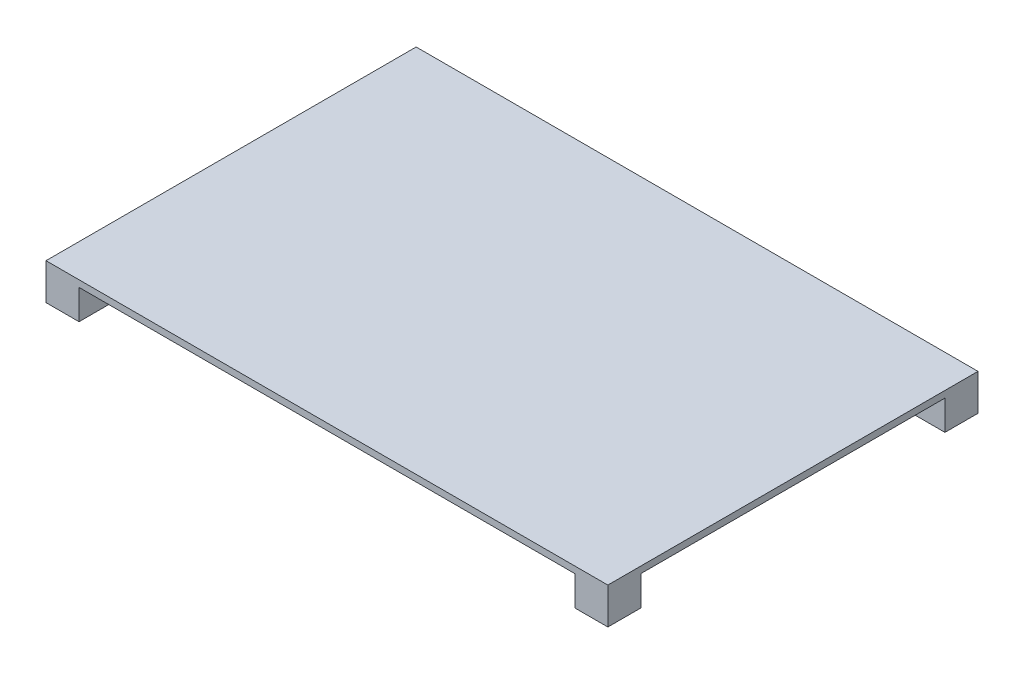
ISO-10303-21;
HEADER;
FILE_DESCRIPTION(('STEP AP214'),'2;1');
FILE_NAME('part.step','',(''),(''),'','','');
FILE_SCHEMA(('AUTOMOTIVE_DESIGN { 1 0 10303 214 1 1 1 1 }'));
ENDSEC;
DATA;
#1=APPLICATION_CONTEXT('core data for automotive mechanical design processes');
#2=APPLICATION_PROTOCOL_DEFINITION('international standard','automotive_design',2000,#1);
#3=PRODUCT_CONTEXT('',#1,'mechanical');
#4=PRODUCT('Part','Part','',(#3));
#5=PRODUCT_RELATED_PRODUCT_CATEGORY('part','',(#4));
#6=PRODUCT_DEFINITION_FORMATION('','',#4);
#7=PRODUCT_DEFINITION_CONTEXT('part definition',#1,'design');
#8=PRODUCT_DEFINITION('design','',#6,#7);
#9=PRODUCT_DEFINITION_SHAPE('','',#8);
#10=(LENGTH_UNIT() NAMED_UNIT(*) SI_UNIT(.MILLI.,.METRE.));
#11=(NAMED_UNIT(*) PLANE_ANGLE_UNIT() SI_UNIT($,.RADIAN.));
#12=(NAMED_UNIT(*) SI_UNIT($,.STERADIAN.) SOLID_ANGLE_UNIT());
#13=UNCERTAINTY_MEASURE_WITH_UNIT(LENGTH_MEASURE(1.E-05),#10,'distance_accuracy_value','');
#14=(GEOMETRIC_REPRESENTATION_CONTEXT(3) GLOBAL_UNCERTAINTY_ASSIGNED_CONTEXT((#13)) GLOBAL_UNIT_ASSIGNED_CONTEXT((#10,
#11,#12)) REPRESENTATION_CONTEXT('',''));
#15=CARTESIAN_POINT('',(0.,0.,0.));
#16=DIRECTION('',(0.,0.,1.));
#17=DIRECTION('',(1.,0.,0.));
#18=AXIS2_PLACEMENT_3D('',#15,#16,#17);
#19=CARTESIAN_POINT('',(0.,0.,0.));
#20=DIRECTION('',(0.,1.,0.));
#21=DIRECTION('',(0.,0.,1.));
#22=AXIS2_PLACEMENT_3D('',#19,#20,#21);
#23=PLANE('',#22);
#24=DIRECTION('',(0.,0.,-1.));
#25=VECTOR('',#24,1.);
#26=CARTESIAN_POINT('',(37.5,0.,28.));
#27=LINE('',#26,#25);
#28=CARTESIAN_POINT('',(37.5,0.,28.));
#29=VERTEX_POINT('',#28);
#30=CARTESIAN_POINT('',(37.5,0.,23.));
#31=VERTEX_POINT('',#30);
#32=EDGE_CURVE('E160',#29,#31,#27,.T.);
#33=ORIENTED_EDGE('',*,*,#32,.F.);
#34=DIRECTION('',(1.,0.,0.));
#35=VECTOR('',#34,1.);
#36=CARTESIAN_POINT('',(42.5,0.,28.));
#37=LINE('',#36,#35);
#38=CARTESIAN_POINT('',(-37.5,0.,28.));
#39=VERTEX_POINT('',#38);
#40=EDGE_CURVE('E311',#39,#29,#37,.T.);
#41=ORIENTED_EDGE('',*,*,#40,.F.);
#42=DIRECTION('',(0.,0.,1.));
#43=VECTOR('',#42,1.);
#44=CARTESIAN_POINT('',(-37.5,0.,28.));
#45=LINE('',#44,#43);
#46=CARTESIAN_POINT('',(-37.5,0.,23.));
#47=VERTEX_POINT('',#46);
#48=EDGE_CURVE('E265',#47,#39,#45,.T.);
#49=ORIENTED_EDGE('',*,*,#48,.F.);
#50=DIRECTION('',(1.,0.,0.));
#51=VECTOR('',#50,1.);
#52=CARTESIAN_POINT('',(-42.5,0.,23.));
#53=LINE('',#52,#51);
#54=CARTESIAN_POINT('',(-42.5,0.,23.));
#55=VERTEX_POINT('',#54);
#56=EDGE_CURVE('E248',#55,#47,#53,.T.);
#57=ORIENTED_EDGE('',*,*,#56,.F.);
#58=DIRECTION('',(0.,0.,1.));
#59=VECTOR('',#58,1.);
#60=CARTESIAN_POINT('',(-42.5,0.,28.));
#61=LINE('',#60,#59);
#62=CARTESIAN_POINT('',(-42.5,0.,-23.));
#63=VERTEX_POINT('',#62);
#64=EDGE_CURVE('E293',#63,#55,#61,.T.);
#65=ORIENTED_EDGE('',*,*,#64,.F.);
#66=DIRECTION('',(-1.,0.,0.));
#67=VECTOR('',#66,1.);
#68=CARTESIAN_POINT('',(-42.5,0.,-23.));
#69=LINE('',#68,#67);
#70=CARTESIAN_POINT('',(-37.5,0.,-23.));
#71=VERTEX_POINT('',#70);
#72=EDGE_CURVE('E241',#71,#63,#69,.T.);
#73=ORIENTED_EDGE('',*,*,#72,.F.);
#74=DIRECTION('',(0.,0.,1.));
#75=VECTOR('',#74,1.);
#76=CARTESIAN_POINT('',(-37.5,0.,-28.));
#77=LINE('',#76,#75);
#78=CARTESIAN_POINT('',(-37.5,0.,-28.));
#79=VERTEX_POINT('',#78);
#80=EDGE_CURVE('E244',#79,#71,#77,.T.);
#81=ORIENTED_EDGE('',*,*,#80,.F.);
#82=DIRECTION('',(-1.,0.,0.));
#83=VECTOR('',#82,1.);
#84=CARTESIAN_POINT('',(42.5,0.,-28.));
#85=LINE('',#84,#83);
#86=CARTESIAN_POINT('',(37.5,0.,-28.));
#87=VERTEX_POINT('',#86);
#88=EDGE_CURVE('E299',#87,#79,#85,.T.);
#89=ORIENTED_EDGE('',*,*,#88,.F.);
#90=DIRECTION('',(0.,0.,-1.));
#91=VECTOR('',#90,1.);
#92=CARTESIAN_POINT('',(37.5,0.,-28.));
#93=LINE('',#92,#91);
#94=CARTESIAN_POINT('',(37.5,0.,-23.));
#95=VERTEX_POINT('',#94);
#96=EDGE_CURVE('E209',#95,#87,#93,.T.);
#97=ORIENTED_EDGE('',*,*,#96,.F.);
#98=DIRECTION('',(-1.,0.,0.));
#99=VECTOR('',#98,1.);
#100=CARTESIAN_POINT('',(42.5,0.,-23.));
#101=LINE('',#100,#99);
#102=CARTESIAN_POINT('',(42.5,0.,-23.));
#103=VERTEX_POINT('',#102);
#104=EDGE_CURVE('E212',#103,#95,#101,.T.);
#105=ORIENTED_EDGE('',*,*,#104,.F.);
#106=DIRECTION('',(0.,0.,-1.));
#107=VECTOR('',#106,1.);
#108=CARTESIAN_POINT('',(42.5,0.,28.));
#109=LINE('',#108,#107);
#110=CARTESIAN_POINT('',(42.5,0.,23.));
#111=VERTEX_POINT('',#110);
#112=EDGE_CURVE('E182',#111,#103,#109,.T.);
#113=ORIENTED_EDGE('',*,*,#112,.F.);
#114=DIRECTION('',(1.,0.,0.));
#115=VECTOR('',#114,1.);
#116=CARTESIAN_POINT('',(42.5,0.,23.));
#117=LINE('',#116,#115);
#118=EDGE_CURVE('E173',#31,#111,#117,.T.);
#119=ORIENTED_EDGE('',*,*,#118,.F.);
#120=EDGE_LOOP('',(#33,#41,#49,#57,#65,#73,#81,#89,#97,#105,#113,#119));
#121=FACE_BOUND('',#120,.T.);
#122=ADVANCED_FACE('F45',(#121),#23,.F.);
#123=CARTESIAN_POINT('',(-42.5,1.,28.));
#124=DIRECTION('',(1.,0.,0.));
#125=DIRECTION('',(0.,0.,-1.));
#126=AXIS2_PLACEMENT_3D('',#123,#124,#125);
#127=PLANE('',#126);
#128=DIRECTION('',(0.,-1.,0.));
#129=VECTOR('',#128,1.);
#130=CARTESIAN_POINT('',(-42.5,1.,-28.));
#131=LINE('',#130,#129);
#132=CARTESIAN_POINT('',(-42.5,1.,-28.));
#133=VERTEX_POINT('',#132);
#134=CARTESIAN_POINT('',(-42.5,-4.5,-28.));
#135=VERTEX_POINT('',#134);
#136=EDGE_CURVE('E308',#133,#135,#131,.T.);
#137=ORIENTED_EDGE('',*,*,#136,.T.);
#138=DIRECTION('',(0.,0.,-1.));
#139=VECTOR('',#138,1.);
#140=CARTESIAN_POINT('',(-42.5,-4.5,-28.));
#141=LINE('',#140,#139);
#142=CARTESIAN_POINT('',(-42.5,-4.5,-23.));
#143=VERTEX_POINT('',#142);
#144=EDGE_CURVE('E245',#143,#135,#141,.T.);
#145=ORIENTED_EDGE('',*,*,#144,.F.);
#146=DIRECTION('',(0.,1.,0.));
#147=VECTOR('',#146,1.);
#148=CARTESIAN_POINT('',(-42.5,-4.5,-23.));
#149=LINE('',#148,#147);
#150=EDGE_CURVE('E236',#143,#63,#149,.T.);
#151=ORIENTED_EDGE('',*,*,#150,.T.);
#152=ORIENTED_EDGE('',*,*,#64,.T.);
#153=DIRECTION('',(0.,1.,0.));
#154=VECTOR('',#153,1.);
#155=CARTESIAN_POINT('',(-42.5,-4.5,23.));
#156=LINE('',#155,#154);
#157=CARTESIAN_POINT('',(-42.5,-4.5,23.));
#158=VERTEX_POINT('',#157);
#159=EDGE_CURVE('E289',#158,#55,#156,.T.);
#160=ORIENTED_EDGE('',*,*,#159,.F.);
#161=DIRECTION('',(0.,0.,-1.));
#162=VECTOR('',#161,1.);
#163=CARTESIAN_POINT('',(-42.5,-4.5,28.));
#164=LINE('',#163,#162);
#165=CARTESIAN_POINT('',(-42.5,-4.5,28.));
#166=VERTEX_POINT('',#165);
#167=EDGE_CURVE('E260',#166,#158,#164,.T.);
#168=ORIENTED_EDGE('',*,*,#167,.F.);
#169=DIRECTION('',(0.,-1.,0.));
#170=VECTOR('',#169,1.);
#171=CARTESIAN_POINT('',(-42.5,1.,28.));
#172=LINE('',#171,#170);
#173=CARTESIAN_POINT('',(-42.5,1.,28.));
#174=VERTEX_POINT('',#173);
#175=EDGE_CURVE('E11',#174,#166,#172,.T.);
#176=ORIENTED_EDGE('',*,*,#175,.F.);
#177=DIRECTION('',(0.,0.,1.));
#178=VECTOR('',#177,1.);
#179=CARTESIAN_POINT('',(-42.5,1.,28.));
#180=LINE('',#179,#178);
#181=EDGE_CURVE('E294',#133,#174,#180,.T.);
#182=ORIENTED_EDGE('',*,*,#181,.F.);
#183=EDGE_LOOP('',(#137,#145,#151,#152,#160,#168,#176,#182));
#184=FACE_BOUND('',#183,.T.);
#185=ADVANCED_FACE('F47',(#184),#127,.F.);
#186=CARTESIAN_POINT('',(42.5,1.,28.));
#187=DIRECTION('',(0.,0.,-1.));
#188=DIRECTION('',(-1.,0.,0.));
#189=AXIS2_PLACEMENT_3D('',#186,#187,#188);
#190=PLANE('',#189);
#191=ORIENTED_EDGE('',*,*,#175,.T.);
#192=DIRECTION('',(-1.,0.,0.));
#193=VECTOR('',#192,1.);
#194=CARTESIAN_POINT('',(-42.5,-4.5,28.));
#195=LINE('',#194,#193);
#196=CARTESIAN_POINT('',(-37.5,-4.5,28.));
#197=VERTEX_POINT('',#196);
#198=EDGE_CURVE('E271',#197,#166,#195,.T.);
#199=ORIENTED_EDGE('',*,*,#198,.F.);
#200=DIRECTION('',(0.,1.,0.));
#201=VECTOR('',#200,1.);
#202=CARTESIAN_POINT('',(-37.5,-4.5,28.));
#203=LINE('',#202,#201);
#204=EDGE_CURVE('E275',#197,#39,#203,.T.);
#205=ORIENTED_EDGE('',*,*,#204,.T.);
#206=ORIENTED_EDGE('',*,*,#40,.T.);
#207=DIRECTION('',(0.,1.,0.));
#208=VECTOR('',#207,1.);
#209=CARTESIAN_POINT('',(37.5,-4.5,28.));
#210=LINE('',#209,#208);
#211=CARTESIAN_POINT('',(37.5,-4.5,28.));
#212=VERTEX_POINT('',#211);
#213=EDGE_CURVE('E167',#212,#29,#210,.T.);
#214=ORIENTED_EDGE('',*,*,#213,.F.);
#215=DIRECTION('',(-1.,0.,0.));
#216=VECTOR('',#215,1.);
#217=CARTESIAN_POINT('',(42.5,-4.5,28.));
#218=LINE('',#217,#216);
#219=CARTESIAN_POINT('',(42.5,-4.5,28.));
#220=VERTEX_POINT('',#219);
#221=EDGE_CURVE('E188',#220,#212,#218,.T.);
#222=ORIENTED_EDGE('',*,*,#221,.F.);
#223=DIRECTION('',(0.,-1.,0.));
#224=VECTOR('',#223,1.);
#225=CARTESIAN_POINT('',(42.5,1.,28.));
#226=LINE('',#225,#224);
#227=CARTESIAN_POINT('',(42.5,1.,28.));
#228=VERTEX_POINT('',#227);
#229=EDGE_CURVE('E54',#228,#220,#226,.T.);
#230=ORIENTED_EDGE('',*,*,#229,.F.);
#231=DIRECTION('',(1.,0.,0.));
#232=VECTOR('',#231,1.);
#233=CARTESIAN_POINT('',(42.5,1.,28.));
#234=LINE('',#233,#232);
#235=EDGE_CURVE('E298',#174,#228,#234,.T.);
#236=ORIENTED_EDGE('',*,*,#235,.F.);
#237=EDGE_LOOP('',(#191,#199,#205,#206,#214,#222,#230,#236));
#238=FACE_BOUND('',#237,.T.);
#239=ADVANCED_FACE('F329',(#238),#190,.F.);
#240=CARTESIAN_POINT('',(42.5,1.,28.));
#241=DIRECTION('',(-1.,0.,0.));
#242=DIRECTION('',(0.,0.,1.));
#243=AXIS2_PLACEMENT_3D('',#240,#241,#242);
#244=PLANE('',#243);
#245=ORIENTED_EDGE('',*,*,#229,.T.);
#246=DIRECTION('',(0.,0.,1.));
#247=VECTOR('',#246,1.);
#248=CARTESIAN_POINT('',(42.5,-4.5,28.));
#249=LINE('',#248,#247);
#250=CARTESIAN_POINT('',(42.5,-4.5,23.));
#251=VERTEX_POINT('',#250);
#252=EDGE_CURVE('E184',#251,#220,#249,.T.);
#253=ORIENTED_EDGE('',*,*,#252,.F.);
#254=DIRECTION('',(0.,1.,0.));
#255=VECTOR('',#254,1.);
#256=CARTESIAN_POINT('',(42.5,-4.5,23.));
#257=LINE('',#256,#255);
#258=EDGE_CURVE('E61',#251,#111,#257,.T.);
#259=ORIENTED_EDGE('',*,*,#258,.T.);
#260=ORIENTED_EDGE('',*,*,#112,.T.);
#261=DIRECTION('',(0.,1.,0.));
#262=VECTOR('',#261,1.);
#263=CARTESIAN_POINT('',(42.5,-4.5,-23.));
#264=LINE('',#263,#262);
#265=CARTESIAN_POINT('',(42.5,-4.5,-23.));
#266=VERTEX_POINT('',#265);
#267=EDGE_CURVE('E172',#266,#103,#264,.T.);
#268=ORIENTED_EDGE('',*,*,#267,.F.);
#269=DIRECTION('',(0.,0.,1.));
#270=VECTOR('',#269,1.);
#271=CARTESIAN_POINT('',(42.5,-4.5,-28.));
#272=LINE('',#271,#270);
#273=CARTESIAN_POINT('',(42.5,-4.5,-28.));
#274=VERTEX_POINT('',#273);
#275=EDGE_CURVE('E213',#274,#266,#272,.T.);
#276=ORIENTED_EDGE('',*,*,#275,.F.);
#277=DIRECTION('',(0.,-1.,0.));
#278=VECTOR('',#277,1.);
#279=CARTESIAN_POINT('',(42.5,1.,-28.));
#280=LINE('',#279,#278);
#281=CARTESIAN_POINT('',(42.5,1.,-28.));
#282=VERTEX_POINT('',#281);
#283=EDGE_CURVE('E320',#282,#274,#280,.T.);
#284=ORIENTED_EDGE('',*,*,#283,.F.);
#285=DIRECTION('',(0.,0.,-1.));
#286=VECTOR('',#285,1.);
#287=CARTESIAN_POINT('',(42.5,1.,28.));
#288=LINE('',#287,#286);
#289=EDGE_CURVE('E302',#228,#282,#288,.T.);
#290=ORIENTED_EDGE('',*,*,#289,.F.);
#291=EDGE_LOOP('',(#245,#253,#259,#260,#268,#276,#284,#290));
#292=FACE_BOUND('',#291,.T.);
#293=ADVANCED_FACE('F326',(#292),#244,.F.);
#294=CARTESIAN_POINT('',(42.5,1.,-28.));
#295=DIRECTION('',(0.,0.,1.));
#296=DIRECTION('',(1.,0.,0.));
#297=AXIS2_PLACEMENT_3D('',#294,#295,#296);
#298=PLANE('',#297);
#299=ORIENTED_EDGE('',*,*,#283,.T.);
#300=DIRECTION('',(1.,0.,0.));
#301=VECTOR('',#300,1.);
#302=CARTESIAN_POINT('',(42.5,-4.5,-28.));
#303=LINE('',#302,#301);
#304=CARTESIAN_POINT('',(37.5,-4.5,-28.));
#305=VERTEX_POINT('',#304);
#306=EDGE_CURVE('E208',#305,#274,#303,.T.);
#307=ORIENTED_EDGE('',*,*,#306,.F.);
#308=DIRECTION('',(0.,1.,0.));
#309=VECTOR('',#308,1.);
#310=CARTESIAN_POINT('',(37.5,-4.5,-28.));
#311=LINE('',#310,#309);
#312=EDGE_CURVE('E69',#305,#87,#311,.T.);
#313=ORIENTED_EDGE('',*,*,#312,.T.);
#314=ORIENTED_EDGE('',*,*,#88,.T.);
#315=DIRECTION('',(0.,1.,0.));
#316=VECTOR('',#315,1.);
#317=CARTESIAN_POINT('',(-37.5,-4.5,-28.));
#318=LINE('',#317,#316);
#319=CARTESIAN_POINT('',(-37.5,-4.5,-28.));
#320=VERTEX_POINT('',#319);
#321=EDGE_CURVE('E216',#320,#79,#318,.T.);
#322=ORIENTED_EDGE('',*,*,#321,.F.);
#323=DIRECTION('',(1.,0.,0.));
#324=VECTOR('',#323,1.);
#325=CARTESIAN_POINT('',(-42.5,-4.5,-28.));
#326=LINE('',#325,#324);
#327=EDGE_CURVE('E254',#135,#320,#326,.T.);
#328=ORIENTED_EDGE('',*,*,#327,.F.);
#329=ORIENTED_EDGE('',*,*,#136,.F.);
#330=DIRECTION('',(-1.,0.,0.));
#331=VECTOR('',#330,1.);
#332=CARTESIAN_POINT('',(42.5,1.,-28.));
#333=LINE('',#332,#331);
#334=EDGE_CURVE('E305',#282,#133,#333,.T.);
#335=ORIENTED_EDGE('',*,*,#334,.F.);
#336=EDGE_LOOP('',(#299,#307,#313,#314,#322,#328,#329,#335));
#337=FACE_BOUND('',#336,.T.);
#338=ADVANCED_FACE('F353',(#337),#298,.F.);
#339=CARTESIAN_POINT('',(0.,1.,0.));
#340=DIRECTION('',(0.,1.,0.));
#341=DIRECTION('',(0.,0.,1.));
#342=AXIS2_PLACEMENT_3D('',#339,#340,#341);
#343=PLANE('',#342);
#344=ORIENTED_EDGE('',*,*,#181,.T.);
#345=ORIENTED_EDGE('',*,*,#235,.T.);
#346=ORIENTED_EDGE('',*,*,#289,.T.);
#347=ORIENTED_EDGE('',*,*,#334,.T.);
#348=EDGE_LOOP('',(#344,#345,#346,#347));
#349=FACE_BOUND('',#348,.T.);
#350=ADVANCED_FACE('F351',(#349),#343,.T.);
#351=CARTESIAN_POINT('',(-42.5,-4.5,23.));
#352=DIRECTION('',(0.,0.,1.));
#353=DIRECTION('',(1.,0.,0.));
#354=AXIS2_PLACEMENT_3D('',#351,#352,#353);
#355=PLANE('',#354);
#356=ORIENTED_EDGE('',*,*,#56,.T.);
#357=DIRECTION('',(0.,1.,0.));
#358=VECTOR('',#357,1.);
#359=CARTESIAN_POINT('',(-37.5,-4.5,23.));
#360=LINE('',#359,#358);
#361=CARTESIAN_POINT('',(-37.5,-4.5,23.));
#362=VERTEX_POINT('',#361);
#363=EDGE_CURVE('E285',#362,#47,#360,.T.);
#364=ORIENTED_EDGE('',*,*,#363,.F.);
#365=DIRECTION('',(1.,0.,0.));
#366=VECTOR('',#365,1.);
#367=CARTESIAN_POINT('',(-42.5,-4.5,23.));
#368=LINE('',#367,#366);
#369=EDGE_CURVE('E264',#158,#362,#368,.T.);
#370=ORIENTED_EDGE('',*,*,#369,.F.);
#371=ORIENTED_EDGE('',*,*,#159,.T.);
#372=EDGE_LOOP('',(#356,#364,#370,#371));
#373=FACE_BOUND('',#372,.T.);
#374=ADVANCED_FACE('F377',(#373),#355,.F.);
#375=CARTESIAN_POINT('',(-37.5,-4.5,28.));
#376=DIRECTION('',(-1.,0.,0.));
#377=DIRECTION('',(0.,0.,1.));
#378=AXIS2_PLACEMENT_3D('',#375,#376,#377);
#379=PLANE('',#378);
#380=ORIENTED_EDGE('',*,*,#48,.T.);
#381=ORIENTED_EDGE('',*,*,#204,.F.);
#382=DIRECTION('',(0.,0.,1.));
#383=VECTOR('',#382,1.);
#384=CARTESIAN_POINT('',(-37.5,-4.5,28.));
#385=LINE('',#384,#383);
#386=EDGE_CURVE('E268',#362,#197,#385,.T.);
#387=ORIENTED_EDGE('',*,*,#386,.F.);
#388=ORIENTED_EDGE('',*,*,#363,.T.);
#389=EDGE_LOOP('',(#380,#381,#387,#388));
#390=FACE_BOUND('',#389,.T.);
#391=ADVANCED_FACE('F380',(#390),#379,.F.);
#392=CARTESIAN_POINT('',(0.,-4.5,0.));
#393=DIRECTION('',(0.,-1.,0.));
#394=DIRECTION('',(0.,0.,-1.));
#395=AXIS2_PLACEMENT_3D('',#392,#393,#394);
#396=PLANE('',#395);
#397=ORIENTED_EDGE('',*,*,#167,.T.);
#398=ORIENTED_EDGE('',*,*,#369,.T.);
#399=ORIENTED_EDGE('',*,*,#386,.T.);
#400=ORIENTED_EDGE('',*,*,#198,.T.);
#401=EDGE_LOOP('',(#397,#398,#399,#400));
#402=FACE_BOUND('',#401,.T.);
#403=ADVANCED_FACE('F388',(#402),#396,.T.);
#404=CARTESIAN_POINT('',(-37.5,-4.5,-28.));
#405=DIRECTION('',(-1.,0.,0.));
#406=DIRECTION('',(0.,0.,1.));
#407=AXIS2_PLACEMENT_3D('',#404,#405,#406);
#408=PLANE('',#407);
#409=ORIENTED_EDGE('',*,*,#80,.T.);
#410=DIRECTION('',(0.,1.,0.));
#411=VECTOR('',#410,1.);
#412=CARTESIAN_POINT('',(-37.5,-4.5,-23.));
#413=LINE('',#412,#411);
#414=CARTESIAN_POINT('',(-37.5,-4.5,-23.));
#415=VERTEX_POINT('',#414);
#416=EDGE_CURVE('E232',#415,#71,#413,.T.);
#417=ORIENTED_EDGE('',*,*,#416,.F.);
#418=DIRECTION('',(0.,0.,1.));
#419=VECTOR('',#418,1.);
#420=CARTESIAN_POINT('',(-37.5,-4.5,-28.));
#421=LINE('',#420,#419);
#422=EDGE_CURVE('E251',#320,#415,#421,.T.);
#423=ORIENTED_EDGE('',*,*,#422,.F.);
#424=ORIENTED_EDGE('',*,*,#321,.T.);
#425=EDGE_LOOP('',(#409,#417,#423,#424));
#426=FACE_BOUND('',#425,.T.);
#427=ADVANCED_FACE('F397',(#426),#408,.F.);
#428=CARTESIAN_POINT('',(-42.5,-4.5,-23.));
#429=DIRECTION('',(0.,0.,-1.));
#430=DIRECTION('',(-1.,0.,0.));
#431=AXIS2_PLACEMENT_3D('',#428,#429,#430);
#432=PLANE('',#431);
#433=ORIENTED_EDGE('',*,*,#72,.T.);
#434=ORIENTED_EDGE('',*,*,#150,.F.);
#435=DIRECTION('',(-1.,0.,0.));
#436=VECTOR('',#435,1.);
#437=CARTESIAN_POINT('',(-42.5,-4.5,-23.));
#438=LINE('',#437,#436);
#439=EDGE_CURVE('E240',#415,#143,#438,.T.);
#440=ORIENTED_EDGE('',*,*,#439,.F.);
#441=ORIENTED_EDGE('',*,*,#416,.T.);
#442=EDGE_LOOP('',(#433,#434,#440,#441));
#443=FACE_BOUND('',#442,.T.);
#444=ADVANCED_FACE('F406',(#443),#432,.F.);
#445=CARTESIAN_POINT('',(0.,-4.5,0.));
#446=DIRECTION('',(0.,1.,0.));
#447=DIRECTION('',(0.,0.,1.));
#448=AXIS2_PLACEMENT_3D('',#445,#446,#447);
#449=PLANE('',#448);
#450=ORIENTED_EDGE('',*,*,#144,.T.);
#451=ORIENTED_EDGE('',*,*,#327,.T.);
#452=ORIENTED_EDGE('',*,*,#422,.T.);
#453=ORIENTED_EDGE('',*,*,#439,.T.);
#454=EDGE_LOOP('',(#450,#451,#452,#453));
#455=FACE_BOUND('',#454,.T.);
#456=ADVANCED_FACE('F415',(#455),#449,.F.);
#457=CARTESIAN_POINT('',(42.5,-4.5,-23.));
#458=DIRECTION('',(0.,0.,-1.));
#459=DIRECTION('',(-1.,0.,0.));
#460=AXIS2_PLACEMENT_3D('',#457,#458,#459);
#461=PLANE('',#460);
#462=ORIENTED_EDGE('',*,*,#104,.T.);
#463=DIRECTION('',(0.,1.,0.));
#464=VECTOR('',#463,1.);
#465=CARTESIAN_POINT('',(37.5,-4.5,-23.));
#466=LINE('',#465,#464);
#467=CARTESIAN_POINT('',(37.5,-4.5,-23.));
#468=VERTEX_POINT('',#467);
#469=EDGE_CURVE('E202',#468,#95,#466,.T.);
#470=ORIENTED_EDGE('',*,*,#469,.F.);
#471=DIRECTION('',(-1.,0.,0.));
#472=VECTOR('',#471,1.);
#473=CARTESIAN_POINT('',(42.5,-4.5,-23.));
#474=LINE('',#473,#472);
#475=EDGE_CURVE('E223',#266,#468,#474,.T.);
#476=ORIENTED_EDGE('',*,*,#475,.F.);
#477=ORIENTED_EDGE('',*,*,#267,.T.);
#478=EDGE_LOOP('',(#462,#470,#476,#477));
#479=FACE_BOUND('',#478,.T.);
#480=ADVANCED_FACE('F424',(#479),#461,.F.);
#481=CARTESIAN_POINT('',(37.5,-4.5,-28.));
#482=DIRECTION('',(1.,0.,0.));
#483=DIRECTION('',(0.,0.,-1.));
#484=AXIS2_PLACEMENT_3D('',#481,#482,#483);
#485=PLANE('',#484);
#486=ORIENTED_EDGE('',*,*,#96,.T.);
#487=ORIENTED_EDGE('',*,*,#312,.F.);
#488=DIRECTION('',(0.,0.,-1.));
#489=VECTOR('',#488,1.);
#490=CARTESIAN_POINT('',(37.5,-4.5,-28.));
#491=LINE('',#490,#489);
#492=EDGE_CURVE('E220',#468,#305,#491,.T.);
#493=ORIENTED_EDGE('',*,*,#492,.F.);
#494=ORIENTED_EDGE('',*,*,#469,.T.);
#495=EDGE_LOOP('',(#486,#487,#493,#494));
#496=FACE_BOUND('',#495,.T.);
#497=ADVANCED_FACE('F433',(#496),#485,.F.);
#498=CARTESIAN_POINT('',(0.,-4.5,0.));
#499=DIRECTION('',(0.,-1.,0.));
#500=DIRECTION('',(0.,0.,-1.));
#501=AXIS2_PLACEMENT_3D('',#498,#499,#500);
#502=PLANE('',#501);
#503=ORIENTED_EDGE('',*,*,#275,.T.);
#504=ORIENTED_EDGE('',*,*,#475,.T.);
#505=ORIENTED_EDGE('',*,*,#492,.T.);
#506=ORIENTED_EDGE('',*,*,#306,.T.);
#507=EDGE_LOOP('',(#503,#504,#505,#506));
#508=FACE_BOUND('',#507,.T.);
#509=ADVANCED_FACE('F441',(#508),#502,.T.);
#510=CARTESIAN_POINT('',(37.5,-4.5,28.));
#511=DIRECTION('',(1.,0.,0.));
#512=DIRECTION('',(0.,0.,-1.));
#513=AXIS2_PLACEMENT_3D('',#510,#511,#512);
#514=PLANE('',#513);
#515=ORIENTED_EDGE('',*,*,#32,.T.);
#516=DIRECTION('',(0.,1.,0.));
#517=VECTOR('',#516,1.);
#518=CARTESIAN_POINT('',(37.5,-4.5,23.));
#519=LINE('',#518,#517);
#520=CARTESIAN_POINT('',(37.5,-4.5,23.));
#521=VERTEX_POINT('',#520);
#522=EDGE_CURVE('E164',#521,#31,#519,.T.);
#523=ORIENTED_EDGE('',*,*,#522,.F.);
#524=DIRECTION('',(0.,0.,-1.));
#525=VECTOR('',#524,1.);
#526=CARTESIAN_POINT('',(37.5,-4.5,28.));
#527=LINE('',#526,#525);
#528=EDGE_CURVE('E194',#212,#521,#527,.T.);
#529=ORIENTED_EDGE('',*,*,#528,.F.);
#530=ORIENTED_EDGE('',*,*,#213,.T.);
#531=EDGE_LOOP('',(#515,#523,#529,#530));
#532=FACE_BOUND('',#531,.T.);
#533=ADVANCED_FACE('F162',(#532),#514,.F.);
#534=CARTESIAN_POINT('',(42.5,-4.5,23.));
#535=DIRECTION('',(0.,0.,1.));
#536=DIRECTION('',(1.,0.,0.));
#537=AXIS2_PLACEMENT_3D('',#534,#535,#536);
#538=PLANE('',#537);
#539=ORIENTED_EDGE('',*,*,#118,.T.);
#540=ORIENTED_EDGE('',*,*,#258,.F.);
#541=DIRECTION('',(1.,0.,0.));
#542=VECTOR('',#541,1.);
#543=CARTESIAN_POINT('',(42.5,-4.5,23.));
#544=LINE('',#543,#542);
#545=EDGE_CURVE('E178',#521,#251,#544,.T.);
#546=ORIENTED_EDGE('',*,*,#545,.F.);
#547=ORIENTED_EDGE('',*,*,#522,.T.);
#548=EDGE_LOOP('',(#539,#540,#546,#547));
#549=FACE_BOUND('',#548,.T.);
#550=ADVANCED_FACE('F176',(#549),#538,.F.);
#551=CARTESIAN_POINT('',(0.,-4.5,0.));
#552=DIRECTION('',(0.,1.,0.));
#553=DIRECTION('',(0.,0.,1.));
#554=AXIS2_PLACEMENT_3D('',#551,#552,#553);
#555=PLANE('',#554);
#556=ORIENTED_EDGE('',*,*,#252,.T.);
#557=ORIENTED_EDGE('',*,*,#221,.T.);
#558=ORIENTED_EDGE('',*,*,#528,.T.);
#559=ORIENTED_EDGE('',*,*,#545,.T.);
#560=EDGE_LOOP('',(#556,#557,#558,#559));
#561=FACE_BOUND('',#560,.T.);
#562=ADVANCED_FACE('F331',(#561),#555,.F.);
#563=CLOSED_SHELL('',(#122,#185,#239,#293,#338,#350,#374,#391,#403,#427,#444,#456,#480,#497,
#509,#533,#550,#562));
#564=MANIFOLD_SOLID_BREP('B2',#563);
#565=ADVANCED_BREP_SHAPE_REPRESENTATION('',(#18,#564),#14);
#566=SHAPE_DEFINITION_REPRESENTATION(#9,#565);
ENDSEC;
END-ISO-10303-21;
